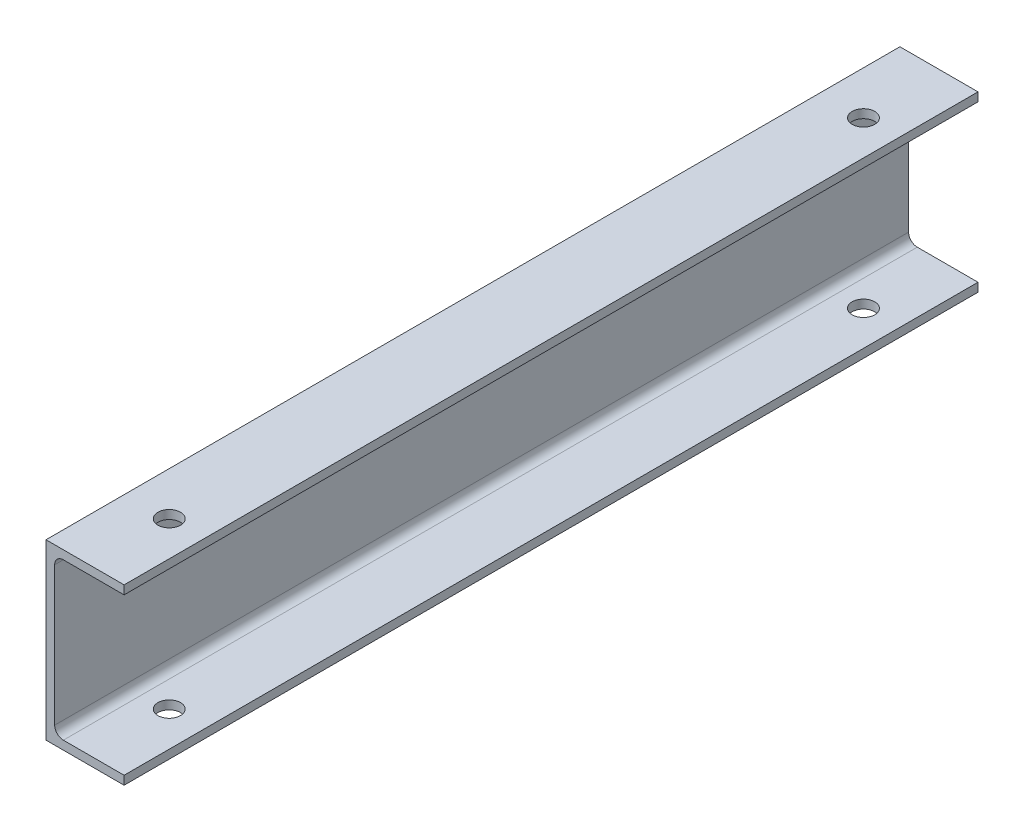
from build123d import *

# Parameters (mm, degrees)
EXTRUDE_1_DEPTH     = 492
SKETCH_2_R          = 6.5
CUT_EXTRUDE_1_DEPTH = 100


with BuildPart() as part:
    # Sketch 1 → Extrude 1 (new body)
    with BuildSketch(Plane.XY):
        with BuildLine():
            Line((0, 0), (0, -100))
            Line((0, -100), (45, -100))
            Line((45, -100), (45, -95))
            Line((45, -95), (10, -95))
            ThreePointArc((10, -95), (6.464466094, -93.535533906), (5, -90))
            Line((5, -90), (5, -10))
            ThreePointArc((5, -10), (6.464466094, -6.464466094), (10, -5))
            Line((10, -5), (45, -5))
            Line((45, -5), (45, 0))
            Line((45, 0), (0, 0))
        make_face()
    extrude(amount=EXTRUDE_1_DEPTH)

    # Sketch 2 → Cut-Extrude 1 (cut)
    with BuildSketch(Plane(origin=(0, 0, 0), x_dir=(1, 0, 0), z_dir=(0, 1, 0))):
        with Locations(Location((25, -46, 0), (0, 0, 180))):
            Circle(SKETCH_2_R)
        with Locations(Location((25, -446, 0), (0, 0, 180))):
            Circle(SKETCH_2_R)
    extrude(amount=-CUT_EXTRUDE_1_DEPTH, mode=Mode.SUBTRACT)


solid = part.part
